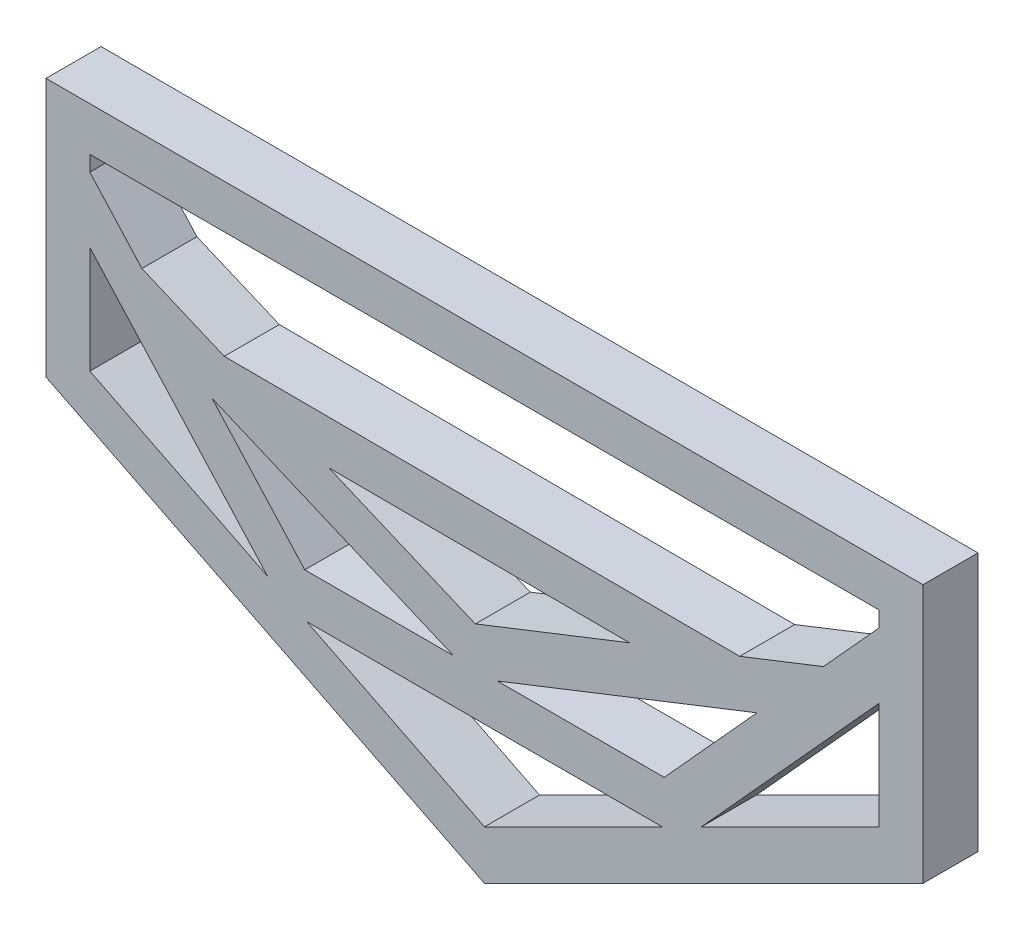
ISO-10303-21;
HEADER;
FILE_DESCRIPTION(('STEP AP214'),'2;1');
FILE_NAME('part.step','',(''),(''),'','','');
FILE_SCHEMA(('AUTOMOTIVE_DESIGN { 1 0 10303 214 1 1 1 1 }'));
ENDSEC;
DATA;
#1=APPLICATION_CONTEXT('core data for automotive mechanical design processes');
#2=APPLICATION_PROTOCOL_DEFINITION('international standard','automotive_design',2000,#1);
#3=PRODUCT_CONTEXT('',#1,'mechanical');
#4=PRODUCT('Part','Part','',(#3));
#5=PRODUCT_RELATED_PRODUCT_CATEGORY('part','',(#4));
#6=PRODUCT_DEFINITION_FORMATION('','',#4);
#7=PRODUCT_DEFINITION_CONTEXT('part definition',#1,'design');
#8=PRODUCT_DEFINITION('design','',#6,#7);
#9=PRODUCT_DEFINITION_SHAPE('','',#8);
#10=(LENGTH_UNIT() NAMED_UNIT(*) SI_UNIT(.MILLI.,.METRE.));
#11=(NAMED_UNIT(*) PLANE_ANGLE_UNIT() SI_UNIT($,.RADIAN.));
#12=(NAMED_UNIT(*) SI_UNIT($,.STERADIAN.) SOLID_ANGLE_UNIT());
#13=UNCERTAINTY_MEASURE_WITH_UNIT(LENGTH_MEASURE(1.E-05),#10,'distance_accuracy_value','');
#14=(GEOMETRIC_REPRESENTATION_CONTEXT(3) GLOBAL_UNCERTAINTY_ASSIGNED_CONTEXT((#13)) GLOBAL_UNIT_ASSIGNED_CONTEXT((#10,
#11,#12)) REPRESENTATION_CONTEXT('',''));
#15=CARTESIAN_POINT('',(0.,0.,0.));
#16=DIRECTION('',(0.,0.,1.));
#17=DIRECTION('',(1.,0.,0.));
#18=AXIS2_PLACEMENT_3D('',#15,#16,#17);
#19=CARTESIAN_POINT('',(0.,0.,19.));
#20=DIRECTION('',(0.,0.,-1.));
#21=DIRECTION('',(-1.,0.,0.));
#22=AXIS2_PLACEMENT_3D('',#19,#20,#21);
#23=PLANE('',#22);
#24=DIRECTION('',(0.671904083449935,-0.740638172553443,0.));
#25=VECTOR('',#24,1.);
#26=CARTESIAN_POINT('',(-57.6586050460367,53.1441461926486,19.));
#27=LINE('',#26,#25);
#28=CARTESIAN_POINT('',(-57.6586050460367,53.1441461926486,19.));
#29=VERTEX_POINT('',#28);
#30=CARTESIAN_POINT('',(-25.6346148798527,17.844182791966,19.));
#31=VERTEX_POINT('',#30);
#32=EDGE_CURVE('E269',#29,#31,#27,.T.);
#33=ORIENTED_EDGE('',*,*,#32,.F.);
#34=DIRECTION('',(-0.920875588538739,0.389856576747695,0.));
#35=VECTOR('',#34,1.);
#36=CARTESIAN_POINT('',(-57.6586050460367,53.1441461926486,19.));
#37=LINE('',#36,#35);
#38=CARTESIAN_POINT('',(25.7230191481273,17.844182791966,19.));
#39=VERTEX_POINT('',#38);
#40=EDGE_CURVE('E275',#39,#29,#37,.T.);
#41=ORIENTED_EDGE('',*,*,#40,.F.);
#42=DIRECTION('',(1.,0.,0.));
#43=VECTOR('',#42,1.);
#44=CARTESIAN_POINT('',(-25.6346148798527,17.844182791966,19.));
#45=LINE('',#44,#43);
#46=EDGE_CURVE('E271',#31,#39,#45,.T.);
#47=ORIENTED_EDGE('',*,*,#46,.F.);
#48=EDGE_LOOP('',(#33,#41,#47));
#49=FACE_BOUND('',#48,.T.);
#50=DIRECTION('',(0.,-1.,0.));
#51=VECTOR('',#50,1.);
#52=CARTESIAN_POINT('',(-99.8571427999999,77.1222571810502,19.));
#53=LINE('',#52,#51);
#54=CARTESIAN_POINT('',(-99.8571427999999,77.1222571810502,19.));
#55=VERTEX_POINT('',#54);
#56=CARTESIAN_POINT('',(-99.8571427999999,40.1588000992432,19.));
#57=VERTEX_POINT('',#56);
#58=EDGE_CURVE('E324',#55,#57,#53,.T.);
#59=ORIENTED_EDGE('',*,*,#58,.F.);
#60=DIRECTION('',(-0.671904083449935,0.740638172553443,0.));
#61=VECTOR('',#60,1.);
#62=CARTESIAN_POINT('',(-99.8571427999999,77.1222571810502,19.));
#63=LINE('',#62,#61);
#64=CARTESIAN_POINT('',(-38.4863770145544,9.47341720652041,19.));
#65=VERTEX_POINT('',#64);
#66=EDGE_CURVE('E330',#65,#55,#63,.T.);
#67=ORIENTED_EDGE('',*,*,#66,.F.);
#68=DIRECTION('',(0.894427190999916,-0.447213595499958,0.));
#69=VECTOR('',#68,1.);
#70=CARTESIAN_POINT('',(-99.8571427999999,40.1588000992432,19.));
#71=LINE('',#70,#69);
#72=EDGE_CURVE('E326',#57,#65,#71,.T.);
#73=ORIENTED_EDGE('',*,*,#72,.F.);
#74=EDGE_LOOP('',(#59,#67,#73));
#75=FACE_BOUND('',#74,.T.);
#76=DIRECTION('',(-1.,0.,0.));
#77=VECTOR('',#76,1.);
#78=CARTESIAN_POINT('',(-99.8571427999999,104.999999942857,19.));
#79=LINE('',#78,#77);
#80=CARTESIAN_POINT('',(172.7142868,104.999999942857,19.));
#81=VERTEX_POINT('',#80);
#82=CARTESIAN_POINT('',(-99.8571427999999,104.999999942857,19.));
#83=VERTEX_POINT('',#82);
#84=EDGE_CURVE('E372',#81,#83,#79,.T.);
#85=ORIENTED_EDGE('',*,*,#84,.F.);
#86=DIRECTION('',(0.,1.,0.));
#87=VECTOR('',#86,1.);
#88=CARTESIAN_POINT('',(172.7142868,104.999999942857,19.));
#89=LINE('',#88,#87);
#90=CARTESIAN_POINT('',(172.7142868,99.659487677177,19.));
#91=VERTEX_POINT('',#90);
#92=EDGE_CURVE('E388',#91,#81,#89,.T.);
#93=ORIENTED_EDGE('',*,*,#92,.F.);
#94=DIRECTION('',(0.671904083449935,0.740638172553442,0.));
#95=VECTOR('',#94,1.);
#96=CARTESIAN_POINT('',(153.484637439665,78.4626938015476,19.));
#97=LINE('',#96,#95);
#98=CARTESIAN_POINT('',(153.484637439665,78.4626938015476,19.));
#99=VERTEX_POINT('',#98);
#100=EDGE_CURVE('E385',#99,#91,#97,.T.);
#101=ORIENTED_EDGE('',*,*,#100,.F.);
#102=DIRECTION('',(0.930467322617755,0.366374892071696,0.));
#103=VECTOR('',#102,1.);
#104=CARTESIAN_POINT('',(124.551423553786,67.0701356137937,19.));
#105=LINE('',#104,#103);
#106=CARTESIAN_POINT('',(124.551423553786,67.0701356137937,19.));
#107=VERTEX_POINT('',#106);
#108=EDGE_CURVE('E383',#107,#99,#105,.T.);
#109=ORIENTED_EDGE('',*,*,#108,.F.);
#110=DIRECTION('',(0.999991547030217,-0.00411167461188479,0.));
#111=VECTOR('',#110,1.);
#112=CARTESIAN_POINT('',(-53.4395837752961,67.8019829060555,19.));
#113=LINE('',#112,#111);
#114=CARTESIAN_POINT('',(-53.4395837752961,67.8019829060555,19.));
#115=VERTEX_POINT('',#114);
#116=EDGE_CURVE('E381',#115,#107,#113,.T.);
#117=ORIENTED_EDGE('',*,*,#116,.F.);
#118=DIRECTION('',(0.920875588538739,-0.389856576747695,0.));
#119=VECTOR('',#118,1.);
#120=CARTESIAN_POINT('',(-81.8785636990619,79.8417453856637,19.));
#121=LINE('',#120,#119);
#122=CARTESIAN_POINT('',(-81.8785636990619,79.8417453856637,19.));
#123=VERTEX_POINT('',#122);
#124=EDGE_CURVE('E379',#123,#115,#121,.T.);
#125=ORIENTED_EDGE('',*,*,#124,.F.);
#126=DIRECTION('',(0.671904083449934,-0.740638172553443,0.));
#127=VECTOR('',#126,1.);
#128=CARTESIAN_POINT('',(-99.8571427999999,99.659487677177,19.));
#129=LINE('',#128,#127);
#130=CARTESIAN_POINT('',(-99.8571427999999,99.659487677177,19.));
#131=VERTEX_POINT('',#130);
#132=EDGE_CURVE('E377',#131,#123,#129,.T.);
#133=ORIENTED_EDGE('',*,*,#132,.F.);
#134=DIRECTION('',(0.,-1.,0.));
#135=VECTOR('',#134,1.);
#136=CARTESIAN_POINT('',(-99.8571427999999,104.999999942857,19.));
#137=LINE('',#136,#135);
#138=EDGE_CURVE('E374',#83,#131,#137,.T.);
#139=ORIENTED_EDGE('',*,*,#138,.F.);
#140=EDGE_LOOP('',(#85,#93,#101,#109,#117,#125,#133,#139));
#141=FACE_BOUND('',#140,.T.);
#142=DIRECTION('',(-1.,0.,0.));
#143=VECTOR('',#142,1.);
#144=CARTESIAN_POINT('',(-115.,120.142857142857,19.));
#145=LINE('',#144,#143);
#146=CARTESIAN_POINT('',(187.857144,120.142857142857,19.));
#147=VERTEX_POINT('',#146);
#148=CARTESIAN_POINT('',(-115.,120.142857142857,19.));
#149=VERTEX_POINT('',#148);
#150=EDGE_CURVE('E455',#147,#149,#145,.T.);
#151=ORIENTED_EDGE('',*,*,#150,.T.);
#152=DIRECTION('',(0.,-1.,0.));
#153=VECTOR('',#152,1.);
#154=CARTESIAN_POINT('',(-115.,120.142857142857,19.));
#155=LINE('',#154,#153);
#156=CARTESIAN_POINT('',(-115.,30.7999996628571,19.));
#157=VERTEX_POINT('',#156);
#158=EDGE_CURVE('E458',#149,#157,#155,.T.);
#159=ORIENTED_EDGE('',*,*,#158,.T.);
#160=DIRECTION('',(0.894427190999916,-0.447213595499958,0.));
#161=VECTOR('',#160,1.);
#162=CARTESIAN_POINT('',(-115.,30.7999996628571,19.));
#163=LINE('',#162,#161);
#164=CARTESIAN_POINT('',(36.4285720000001,-44.9142863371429,19.));
#165=VERTEX_POINT('',#164);
#166=EDGE_CURVE('E461',#157,#165,#163,.T.);
#167=ORIENTED_EDGE('',*,*,#166,.T.);
#168=DIRECTION('',(0.894427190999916,0.447213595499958,0.));
#169=VECTOR('',#168,1.);
#170=CARTESIAN_POINT('',(36.4285720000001,-44.9142863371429,19.));
#171=LINE('',#170,#169);
#172=CARTESIAN_POINT('',(187.857144,30.7999996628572,19.));
#173=VERTEX_POINT('',#172);
#174=EDGE_CURVE('E463',#165,#173,#171,.T.);
#175=ORIENTED_EDGE('',*,*,#174,.T.);
#176=DIRECTION('',(0.,1.,0.));
#177=VECTOR('',#176,1.);
#178=CARTESIAN_POINT('',(187.857144,120.142857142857,19.));
#179=LINE('',#178,#177);
#180=EDGE_CURVE('E465',#173,#147,#179,.T.);
#181=ORIENTED_EDGE('',*,*,#180,.T.);
#182=EDGE_LOOP('',(#151,#159,#167,#175,#181));
#183=FACE_BOUND('',#182,.T.);
#184=DIRECTION('',(0.,1.,0.));
#185=VECTOR('',#184,1.);
#186=CARTESIAN_POINT('',(172.7142868,77.1222571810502,19.));
#187=LINE('',#186,#185);
#188=CARTESIAN_POINT('',(172.7142868,40.1588000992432,19.));
#189=VERTEX_POINT('',#188);
#190=CARTESIAN_POINT('',(172.7142868,77.1222571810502,19.));
#191=VERTEX_POINT('',#190);
#192=EDGE_CURVE('E431',#189,#191,#187,.T.);
#193=ORIENTED_EDGE('',*,*,#192,.F.);
#194=DIRECTION('',(0.894427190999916,0.447213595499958,0.));
#195=VECTOR('',#194,1.);
#196=CARTESIAN_POINT('',(111.343521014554,9.47341720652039,19.));
#197=LINE('',#196,#195);
#198=CARTESIAN_POINT('',(111.343521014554,9.47341720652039,19.));
#199=VERTEX_POINT('',#198);
#200=EDGE_CURVE('E437',#199,#189,#197,.T.);
#201=ORIENTED_EDGE('',*,*,#200,.F.);
#202=DIRECTION('',(-0.671904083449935,-0.740638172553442,0.));
#203=VECTOR('',#202,1.);
#204=CARTESIAN_POINT('',(111.343521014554,9.47341720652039,19.));
#205=LINE('',#204,#203);
#206=EDGE_CURVE('E433',#191,#199,#205,.T.);
#207=ORIENTED_EDGE('',*,*,#206,.F.);
#208=EDGE_LOOP('',(#193,#201,#207));
#209=FACE_BOUND('',#208,.T.);
#210=DIRECTION('',(0.894427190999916,-0.447213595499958,0.));
#211=VECTOR('',#210,1.);
#212=CARTESIAN_POINT('',(-24.9421937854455,2.70132559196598,19.));
#213=LINE('',#212,#211);
#214=CARTESIAN_POINT('',(-24.9421937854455,2.70132559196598,19.));
#215=VERTEX_POINT('',#214);
#216=CARTESIAN_POINT('',(36.4285720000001,-27.9840573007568,19.));
#217=VERTEX_POINT('',#216);
#218=EDGE_CURVE('E348',#215,#217,#213,.T.);
#219=ORIENTED_EDGE('',*,*,#218,.F.);
#220=DIRECTION('',(-1.,0.,0.));
#221=VECTOR('',#220,1.);
#222=CARTESIAN_POINT('',(-24.9421937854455,2.70132559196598,19.));
#223=LINE('',#222,#221);
#224=CARTESIAN_POINT('',(97.7993377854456,2.70132559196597,19.));
#225=VERTEX_POINT('',#224);
#226=EDGE_CURVE('E354',#225,#215,#223,.T.);
#227=ORIENTED_EDGE('',*,*,#226,.F.);
#228=DIRECTION('',(0.894427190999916,0.447213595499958,0.));
#229=VECTOR('',#228,1.);
#230=CARTESIAN_POINT('',(36.4285720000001,-27.9840573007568,19.));
#231=LINE('',#230,#229);
#232=EDGE_CURVE('E350',#217,#225,#231,.T.);
#233=ORIENTED_EDGE('',*,*,#232,.F.);
#234=EDGE_LOOP('',(#219,#227,#233));
#235=FACE_BOUND('',#234,.T.);
#236=DIRECTION('',(0.930467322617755,0.366374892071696,0.));
#237=VECTOR('',#236,1.);
#238=CARTESIAN_POINT('',(33.2944477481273,31.1373695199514,19.));
#239=LINE('',#238,#237);
#240=CARTESIAN_POINT('',(33.2944477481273,31.1373695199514,19.));
#241=VERTEX_POINT('',#240);
#242=CARTESIAN_POINT('',(86.4908451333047,52.0836444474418,19.));
#243=VERTEX_POINT('',#242);
#244=EDGE_CURVE('E293',#241,#243,#239,.T.);
#245=ORIENTED_EDGE('',*,*,#244,.F.);
#246=DIRECTION('',(-2.54144745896E-13,1.,0.));
#247=VECTOR('',#246,1.);
#248=CARTESIAN_POINT('',(33.2944477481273,31.1373695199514,19.));
#249=LINE('',#248,#247);
#250=CARTESIAN_POINT('',(33.2944477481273,31.0827636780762,19.));
#251=VERTEX_POINT('',#250);
#252=EDGE_CURVE('E301',#251,#241,#249,.T.);
#253=ORIENTED_EDGE('',*,*,#252,.F.);
#254=DIRECTION('',(0.920875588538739,-0.389856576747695,0.));
#255=VECTOR('',#254,1.);
#256=CARTESIAN_POINT('',(-17.3197142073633,52.5104832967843,19.));
#257=LINE('',#256,#255);
#258=CARTESIAN_POINT('',(-17.3197142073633,52.5104832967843,19.));
#259=VERTEX_POINT('',#258);
#260=EDGE_CURVE('E298',#259,#251,#257,.T.);
#261=ORIENTED_EDGE('',*,*,#260,.F.);
#262=DIRECTION('',(-0.999991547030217,0.00411167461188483,0.));
#263=VECTOR('',#262,1.);
#264=CARTESIAN_POINT('',(-17.3197142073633,52.5104832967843,19.));
#265=LINE('',#264,#263);
#266=EDGE_CURVE('E295',#243,#259,#265,.T.);
#267=ORIENTED_EDGE('',*,*,#266,.F.);
#268=EDGE_LOOP('',(#245,#253,#261,#267));
#269=FACE_BOUND('',#268,.T.);
#270=DIRECTION('',(1.,0.,0.));
#271=VECTOR('',#270,1.);
#272=CARTESIAN_POINT('',(40.8658763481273,17.844182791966,19.));
#273=LINE('',#272,#271);
#274=CARTESIAN_POINT('',(40.8658763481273,17.844182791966,19.));
#275=VERTEX_POINT('',#274);
#276=CARTESIAN_POINT('',(98.4917588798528,17.844182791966,19.));
#277=VERTEX_POINT('',#276);
#278=EDGE_CURVE('E242',#275,#277,#273,.T.);
#279=ORIENTED_EDGE('',*,*,#278,.F.);
#280=DIRECTION('',(-0.930467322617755,-0.366374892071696,0.));
#281=VECTOR('',#280,1.);
#282=CARTESIAN_POINT('',(40.8658763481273,17.844182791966,19.));
#283=LINE('',#282,#281);
#284=CARTESIAN_POINT('',(130.515749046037,53.1441461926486,19.));
#285=VERTEX_POINT('',#284);
#286=EDGE_CURVE('E259',#285,#275,#283,.T.);
#287=ORIENTED_EDGE('',*,*,#286,.F.);
#288=DIRECTION('',(0.671904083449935,0.740638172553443,0.));
#289=VECTOR('',#288,1.);
#290=CARTESIAN_POINT('',(98.4917588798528,17.844182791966,19.));
#291=LINE('',#290,#289);
#292=EDGE_CURVE('E250',#277,#285,#291,.T.);
#293=ORIENTED_EDGE('',*,*,#292,.F.);
#294=EDGE_LOOP('',(#279,#287,#293));
#295=FACE_BOUND('',#294,.T.);
#296=ADVANCED_FACE('F33',(#49,#75,#141,#183,#209,#235,#269,#295),#23,.F.);
#297=CARTESIAN_POINT('',(0.,0.,0.));
#298=DIRECTION('',(0.,0.,-1.));
#299=DIRECTION('',(-1.,0.,0.));
#300=AXIS2_PLACEMENT_3D('',#297,#298,#299);
#301=PLANE('',#300);
#302=DIRECTION('',(-1.,0.,0.));
#303=VECTOR('',#302,1.);
#304=CARTESIAN_POINT('',(-115.,120.142857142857,0.));
#305=LINE('',#304,#303);
#306=CARTESIAN_POINT('',(187.857144,120.142857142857,0.));
#307=VERTEX_POINT('',#306);
#308=CARTESIAN_POINT('',(-115.,120.142857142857,0.));
#309=VERTEX_POINT('',#308);
#310=EDGE_CURVE('E454',#307,#309,#305,.T.);
#311=ORIENTED_EDGE('',*,*,#310,.F.);
#312=DIRECTION('',(0.,1.,0.));
#313=VECTOR('',#312,1.);
#314=CARTESIAN_POINT('',(187.857144,120.142857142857,0.));
#315=LINE('',#314,#313);
#316=CARTESIAN_POINT('',(187.857144,30.7999996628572,0.));
#317=VERTEX_POINT('',#316);
#318=EDGE_CURVE('E459',#317,#307,#315,.T.);
#319=ORIENTED_EDGE('',*,*,#318,.F.);
#320=DIRECTION('',(0.894427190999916,0.447213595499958,0.));
#321=VECTOR('',#320,1.);
#322=CARTESIAN_POINT('',(36.4285720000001,-44.9142863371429,0.));
#323=LINE('',#322,#321);
#324=CARTESIAN_POINT('',(36.4285720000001,-44.9142863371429,0.));
#325=VERTEX_POINT('',#324);
#326=EDGE_CURVE('E474',#325,#317,#323,.T.);
#327=ORIENTED_EDGE('',*,*,#326,.F.);
#328=DIRECTION('',(0.894427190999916,-0.447213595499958,0.));
#329=VECTOR('',#328,1.);
#330=CARTESIAN_POINT('',(-115.,30.7999996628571,0.));
#331=LINE('',#330,#329);
#332=CARTESIAN_POINT('',(-115.,30.7999996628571,0.));
#333=VERTEX_POINT('',#332);
#334=EDGE_CURVE('E472',#333,#325,#331,.T.);
#335=ORIENTED_EDGE('',*,*,#334,.F.);
#336=DIRECTION('',(0.,-1.,0.));
#337=VECTOR('',#336,1.);
#338=CARTESIAN_POINT('',(-115.,120.142857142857,0.));
#339=LINE('',#338,#337);
#340=EDGE_CURVE('E470',#309,#333,#339,.T.);
#341=ORIENTED_EDGE('',*,*,#340,.F.);
#342=EDGE_LOOP('',(#311,#319,#327,#335,#341));
#343=FACE_BOUND('',#342,.T.);
#344=DIRECTION('',(0.894427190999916,0.447213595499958,0.));
#345=VECTOR('',#344,1.);
#346=CARTESIAN_POINT('',(111.343521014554,9.47341720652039,0.));
#347=LINE('',#346,#345);
#348=CARTESIAN_POINT('',(111.343521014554,9.47341720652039,0.));
#349=VERTEX_POINT('',#348);
#350=CARTESIAN_POINT('',(172.7142868,40.1588000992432,0.));
#351=VERTEX_POINT('',#350);
#352=EDGE_CURVE('E434',#349,#351,#347,.T.);
#353=ORIENTED_EDGE('',*,*,#352,.T.);
#354=DIRECTION('',(0.,1.,0.));
#355=VECTOR('',#354,1.);
#356=CARTESIAN_POINT('',(172.7142868,77.1222571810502,0.));
#357=LINE('',#356,#355);
#358=CARTESIAN_POINT('',(172.7142868,77.1222571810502,0.));
#359=VERTEX_POINT('',#358);
#360=EDGE_CURVE('E430',#351,#359,#357,.T.);
#361=ORIENTED_EDGE('',*,*,#360,.T.);
#362=DIRECTION('',(-0.671904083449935,-0.740638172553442,0.));
#363=VECTOR('',#362,1.);
#364=CARTESIAN_POINT('',(111.343521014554,9.47341720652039,0.));
#365=LINE('',#364,#363);
#366=EDGE_CURVE('E442',#359,#349,#365,.T.);
#367=ORIENTED_EDGE('',*,*,#366,.T.);
#368=EDGE_LOOP('',(#353,#361,#367));
#369=FACE_BOUND('',#368,.T.);
#370=DIRECTION('',(0.,1.,0.));
#371=VECTOR('',#370,1.);
#372=CARTESIAN_POINT('',(172.7142868,104.999999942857,0.));
#373=LINE('',#372,#371);
#374=CARTESIAN_POINT('',(172.7142868,99.659487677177,0.));
#375=VERTEX_POINT('',#374);
#376=CARTESIAN_POINT('',(172.7142868,104.999999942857,0.));
#377=VERTEX_POINT('',#376);
#378=EDGE_CURVE('E375',#375,#377,#373,.T.);
#379=ORIENTED_EDGE('',*,*,#378,.T.);
#380=DIRECTION('',(-1.,0.,0.));
#381=VECTOR('',#380,1.);
#382=CARTESIAN_POINT('',(-99.8571427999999,104.999999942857,0.));
#383=LINE('',#382,#381);
#384=CARTESIAN_POINT('',(-99.8571427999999,104.999999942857,0.));
#385=VERTEX_POINT('',#384);
#386=EDGE_CURVE('E371',#377,#385,#383,.T.);
#387=ORIENTED_EDGE('',*,*,#386,.T.);
#388=DIRECTION('',(0.,-1.,0.));
#389=VECTOR('',#388,1.);
#390=CARTESIAN_POINT('',(-99.8571427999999,104.999999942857,0.));
#391=LINE('',#390,#389);
#392=CARTESIAN_POINT('',(-99.8571427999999,99.659487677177,0.));
#393=VERTEX_POINT('',#392);
#394=EDGE_CURVE('E393',#385,#393,#391,.T.);
#395=ORIENTED_EDGE('',*,*,#394,.T.);
#396=DIRECTION('',(0.671904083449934,-0.740638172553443,0.));
#397=VECTOR('',#396,1.);
#398=CARTESIAN_POINT('',(-99.8571427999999,99.659487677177,0.));
#399=LINE('',#398,#397);
#400=CARTESIAN_POINT('',(-81.8785636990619,79.8417453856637,0.));
#401=VERTEX_POINT('',#400);
#402=EDGE_CURVE('E396',#393,#401,#399,.T.);
#403=ORIENTED_EDGE('',*,*,#402,.T.);
#404=DIRECTION('',(0.920875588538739,-0.389856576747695,0.));
#405=VECTOR('',#404,1.);
#406=CARTESIAN_POINT('',(-81.8785636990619,79.8417453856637,0.));
#407=LINE('',#406,#405);
#408=CARTESIAN_POINT('',(-53.4395837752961,67.8019829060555,0.));
#409=VERTEX_POINT('',#408);
#410=EDGE_CURVE('E399',#401,#409,#407,.T.);
#411=ORIENTED_EDGE('',*,*,#410,.T.);
#412=DIRECTION('',(0.999991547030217,-0.00411167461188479,0.));
#413=VECTOR('',#412,1.);
#414=CARTESIAN_POINT('',(-53.4395837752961,67.8019829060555,0.));
#415=LINE('',#414,#413);
#416=CARTESIAN_POINT('',(124.551423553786,67.0701356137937,0.));
#417=VERTEX_POINT('',#416);
#418=EDGE_CURVE('E402',#409,#417,#415,.T.);
#419=ORIENTED_EDGE('',*,*,#418,.T.);
#420=DIRECTION('',(0.930467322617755,0.366374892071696,0.));
#421=VECTOR('',#420,1.);
#422=CARTESIAN_POINT('',(124.551423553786,67.0701356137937,0.));
#423=LINE('',#422,#421);
#424=CARTESIAN_POINT('',(153.484637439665,78.4626938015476,0.));
#425=VERTEX_POINT('',#424);
#426=EDGE_CURVE('E405',#417,#425,#423,.T.);
#427=ORIENTED_EDGE('',*,*,#426,.T.);
#428=DIRECTION('',(0.671904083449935,0.740638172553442,0.));
#429=VECTOR('',#428,1.);
#430=CARTESIAN_POINT('',(153.484637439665,78.4626938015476,0.));
#431=LINE('',#430,#429);
#432=EDGE_CURVE('E408',#425,#375,#431,.T.);
#433=ORIENTED_EDGE('',*,*,#432,.T.);
#434=EDGE_LOOP('',(#379,#387,#395,#403,#411,#419,#427,#433));
#435=FACE_BOUND('',#434,.T.);
#436=DIRECTION('',(-1.,0.,0.));
#437=VECTOR('',#436,1.);
#438=CARTESIAN_POINT('',(-24.9421937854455,2.70132559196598,0.));
#439=LINE('',#438,#437);
#440=CARTESIAN_POINT('',(97.7993377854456,2.70132559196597,0.));
#441=VERTEX_POINT('',#440);
#442=CARTESIAN_POINT('',(-24.9421937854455,2.70132559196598,0.));
#443=VERTEX_POINT('',#442);
#444=EDGE_CURVE('E351',#441,#443,#439,.T.);
#445=ORIENTED_EDGE('',*,*,#444,.T.);
#446=DIRECTION('',(0.894427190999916,-0.447213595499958,0.));
#447=VECTOR('',#446,1.);
#448=CARTESIAN_POINT('',(-24.9421937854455,2.70132559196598,0.));
#449=LINE('',#448,#447);
#450=CARTESIAN_POINT('',(36.4285720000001,-27.9840573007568,0.));
#451=VERTEX_POINT('',#450);
#452=EDGE_CURVE('E347',#443,#451,#449,.T.);
#453=ORIENTED_EDGE('',*,*,#452,.T.);
#454=DIRECTION('',(0.894427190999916,0.447213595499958,0.));
#455=VECTOR('',#454,1.);
#456=CARTESIAN_POINT('',(36.4285720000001,-27.9840573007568,0.));
#457=LINE('',#456,#455);
#458=EDGE_CURVE('E359',#451,#441,#457,.T.);
#459=ORIENTED_EDGE('',*,*,#458,.T.);
#460=EDGE_LOOP('',(#445,#453,#459));
#461=FACE_BOUND('',#460,.T.);
#462=DIRECTION('',(-0.671904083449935,0.740638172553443,0.));
#463=VECTOR('',#462,1.);
#464=CARTESIAN_POINT('',(-99.8571427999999,77.1222571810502,0.));
#465=LINE('',#464,#463);
#466=CARTESIAN_POINT('',(-38.4863770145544,9.47341720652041,0.));
#467=VERTEX_POINT('',#466);
#468=CARTESIAN_POINT('',(-99.8571427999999,77.1222571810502,0.));
#469=VERTEX_POINT('',#468);
#470=EDGE_CURVE('E327',#467,#469,#465,.T.);
#471=ORIENTED_EDGE('',*,*,#470,.T.);
#472=DIRECTION('',(0.,-1.,0.));
#473=VECTOR('',#472,1.);
#474=CARTESIAN_POINT('',(-99.8571427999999,77.1222571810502,0.));
#475=LINE('',#474,#473);
#476=CARTESIAN_POINT('',(-99.8571427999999,40.1588000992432,0.));
#477=VERTEX_POINT('',#476);
#478=EDGE_CURVE('E323',#469,#477,#475,.T.);
#479=ORIENTED_EDGE('',*,*,#478,.T.);
#480=DIRECTION('',(0.894427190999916,-0.447213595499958,0.));
#481=VECTOR('',#480,1.);
#482=CARTESIAN_POINT('',(-99.8571427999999,40.1588000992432,0.));
#483=LINE('',#482,#481);
#484=EDGE_CURVE('E335',#477,#467,#483,.T.);
#485=ORIENTED_EDGE('',*,*,#484,.T.);
#486=EDGE_LOOP('',(#471,#479,#485));
#487=FACE_BOUND('',#486,.T.);
#488=DIRECTION('',(-2.54144745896E-13,1.,0.));
#489=VECTOR('',#488,1.);
#490=CARTESIAN_POINT('',(33.2944477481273,31.1373695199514,0.));
#491=LINE('',#490,#489);
#492=CARTESIAN_POINT('',(33.2944477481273,31.0827636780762,0.));
#493=VERTEX_POINT('',#492);
#494=CARTESIAN_POINT('',(33.2944477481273,31.1373695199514,0.));
#495=VERTEX_POINT('',#494);
#496=EDGE_CURVE('E296',#493,#495,#491,.T.);
#497=ORIENTED_EDGE('',*,*,#496,.T.);
#498=DIRECTION('',(0.930467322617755,0.366374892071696,0.));
#499=VECTOR('',#498,1.);
#500=CARTESIAN_POINT('',(33.2944477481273,31.1373695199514,0.));
#501=LINE('',#500,#499);
#502=CARTESIAN_POINT('',(86.4908451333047,52.0836444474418,0.));
#503=VERTEX_POINT('',#502);
#504=EDGE_CURVE('E292',#495,#503,#501,.T.);
#505=ORIENTED_EDGE('',*,*,#504,.T.);
#506=DIRECTION('',(-0.999991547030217,0.00411167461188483,0.));
#507=VECTOR('',#506,1.);
#508=CARTESIAN_POINT('',(-17.3197142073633,52.5104832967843,0.));
#509=LINE('',#508,#507);
#510=CARTESIAN_POINT('',(-17.3197142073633,52.5104832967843,0.));
#511=VERTEX_POINT('',#510);
#512=EDGE_CURVE('E306',#503,#511,#509,.T.);
#513=ORIENTED_EDGE('',*,*,#512,.T.);
#514=DIRECTION('',(0.920875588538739,-0.389856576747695,0.));
#515=VECTOR('',#514,1.);
#516=CARTESIAN_POINT('',(-17.3197142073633,52.5104832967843,0.));
#517=LINE('',#516,#515);
#518=EDGE_CURVE('E309',#511,#493,#517,.T.);
#519=ORIENTED_EDGE('',*,*,#518,.T.);
#520=EDGE_LOOP('',(#497,#505,#513,#519));
#521=FACE_BOUND('',#520,.T.);
#522=DIRECTION('',(-0.920875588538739,0.389856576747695,0.));
#523=VECTOR('',#522,1.);
#524=CARTESIAN_POINT('',(-57.6586050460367,53.1441461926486,0.));
#525=LINE('',#524,#523);
#526=CARTESIAN_POINT('',(25.7230191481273,17.844182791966,0.));
#527=VERTEX_POINT('',#526);
#528=CARTESIAN_POINT('',(-57.6586050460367,53.1441461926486,0.));
#529=VERTEX_POINT('',#528);
#530=EDGE_CURVE('E272',#527,#529,#525,.T.);
#531=ORIENTED_EDGE('',*,*,#530,.T.);
#532=DIRECTION('',(0.671904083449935,-0.740638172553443,0.));
#533=VECTOR('',#532,1.);
#534=CARTESIAN_POINT('',(-57.6586050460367,53.1441461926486,0.));
#535=LINE('',#534,#533);
#536=CARTESIAN_POINT('',(-25.6346148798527,17.844182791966,0.));
#537=VERTEX_POINT('',#536);
#538=EDGE_CURVE('E257',#529,#537,#535,.T.);
#539=ORIENTED_EDGE('',*,*,#538,.T.);
#540=DIRECTION('',(1.,0.,0.));
#541=VECTOR('',#540,1.);
#542=CARTESIAN_POINT('',(-25.6346148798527,17.844182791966,0.));
#543=LINE('',#542,#541);
#544=EDGE_CURVE('E280',#537,#527,#543,.T.);
#545=ORIENTED_EDGE('',*,*,#544,.T.);
#546=EDGE_LOOP('',(#531,#539,#545));
#547=FACE_BOUND('',#546,.T.);
#548=DIRECTION('',(-0.930467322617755,-0.366374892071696,0.));
#549=VECTOR('',#548,1.);
#550=CARTESIAN_POINT('',(40.8658763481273,17.844182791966,0.));
#551=LINE('',#550,#549);
#552=CARTESIAN_POINT('',(130.515749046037,53.1441461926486,0.));
#553=VERTEX_POINT('',#552);
#554=CARTESIAN_POINT('',(40.8658763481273,17.844182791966,0.));
#555=VERTEX_POINT('',#554);
#556=EDGE_CURVE('E251',#553,#555,#551,.T.);
#557=ORIENTED_EDGE('',*,*,#556,.T.);
#558=DIRECTION('',(1.,0.,0.));
#559=VECTOR('',#558,1.);
#560=CARTESIAN_POINT('',(40.8658763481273,17.844182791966,0.));
#561=LINE('',#560,#559);
#562=CARTESIAN_POINT('',(98.4917588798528,17.844182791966,0.));
#563=VERTEX_POINT('',#562);
#564=EDGE_CURVE('E56',#555,#563,#561,.T.);
#565=ORIENTED_EDGE('',*,*,#564,.T.);
#566=DIRECTION('',(0.671904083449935,0.740638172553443,0.));
#567=VECTOR('',#566,1.);
#568=CARTESIAN_POINT('',(98.4917588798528,17.844182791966,0.));
#569=LINE('',#568,#567);
#570=EDGE_CURVE('E256',#563,#553,#569,.T.);
#571=ORIENTED_EDGE('',*,*,#570,.T.);
#572=EDGE_LOOP('',(#557,#565,#571));
#573=FACE_BOUND('',#572,.T.);
#574=ADVANCED_FACE('F495',(#343,#369,#435,#461,#487,#521,#547,#573),#301,.T.);
#575=CARTESIAN_POINT('',(-115.,120.142857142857,19.));
#576=DIRECTION('',(0.,-1.,0.));
#577=DIRECTION('',(0.,0.,-1.));
#578=AXIS2_PLACEMENT_3D('',#575,#576,#577);
#579=PLANE('',#578);
#580=ORIENTED_EDGE('',*,*,#310,.T.);
#581=DIRECTION('',(0.,0.,-1.));
#582=VECTOR('',#581,1.);
#583=CARTESIAN_POINT('',(-115.,120.142857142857,19.));
#584=LINE('',#583,#582);
#585=EDGE_CURVE('E11',#149,#309,#584,.T.);
#586=ORIENTED_EDGE('',*,*,#585,.F.);
#587=ORIENTED_EDGE('',*,*,#150,.F.);
#588=DIRECTION('',(0.,0.,-1.));
#589=VECTOR('',#588,1.);
#590=CARTESIAN_POINT('',(187.857144,120.142857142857,19.));
#591=LINE('',#590,#589);
#592=EDGE_CURVE('E467',#147,#307,#591,.T.);
#593=ORIENTED_EDGE('',*,*,#592,.T.);
#594=EDGE_LOOP('',(#580,#586,#587,#593));
#595=FACE_BOUND('',#594,.T.);
#596=ADVANCED_FACE('F35',(#595),#579,.F.);
#597=CARTESIAN_POINT('',(-115.,120.142857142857,19.));
#598=DIRECTION('',(1.,0.,0.));
#599=DIRECTION('',(0.,1.,0.));
#600=AXIS2_PLACEMENT_3D('',#597,#598,#599);
#601=PLANE('',#600);
#602=ORIENTED_EDGE('',*,*,#340,.T.);
#603=DIRECTION('',(0.,0.,-1.));
#604=VECTOR('',#603,1.);
#605=CARTESIAN_POINT('',(-115.,30.7999996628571,19.));
#606=LINE('',#605,#604);
#607=EDGE_CURVE('E41',#157,#333,#606,.T.);
#608=ORIENTED_EDGE('',*,*,#607,.F.);
#609=ORIENTED_EDGE('',*,*,#158,.F.);
#610=ORIENTED_EDGE('',*,*,#585,.T.);
#611=EDGE_LOOP('',(#602,#608,#609,#610));
#612=FACE_BOUND('',#611,.T.);
#613=ADVANCED_FACE('F510',(#612),#601,.F.);
#614=CARTESIAN_POINT('',(-115.,30.7999996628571,19.));
#615=DIRECTION('',(0.447213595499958,0.894427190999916,0.));
#616=DIRECTION('',(-0.894427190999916,0.447213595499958,0.));
#617=AXIS2_PLACEMENT_3D('',#614,#615,#616);
#618=PLANE('',#617);
#619=ORIENTED_EDGE('',*,*,#334,.T.);
#620=DIRECTION('',(0.,0.,-1.));
#621=VECTOR('',#620,1.);
#622=CARTESIAN_POINT('',(36.4285720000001,-44.9142863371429,19.));
#623=LINE('',#622,#621);
#624=EDGE_CURVE('E482',#165,#325,#623,.T.);
#625=ORIENTED_EDGE('',*,*,#624,.F.);
#626=ORIENTED_EDGE('',*,*,#166,.F.);
#627=ORIENTED_EDGE('',*,*,#607,.T.);
#628=EDGE_LOOP('',(#619,#625,#626,#627));
#629=FACE_BOUND('',#628,.T.);
#630=ADVANCED_FACE('F489',(#629),#618,.F.);
#631=CARTESIAN_POINT('',(36.4285720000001,-44.9142863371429,19.));
#632=DIRECTION('',(-0.447213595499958,0.894427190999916,0.));
#633=DIRECTION('',(-0.894427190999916,-0.447213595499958,0.));
#634=AXIS2_PLACEMENT_3D('',#631,#632,#633);
#635=PLANE('',#634);
#636=ORIENTED_EDGE('',*,*,#326,.T.);
#637=DIRECTION('',(0.,0.,-1.));
#638=VECTOR('',#637,1.);
#639=CARTESIAN_POINT('',(187.857144,30.7999996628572,19.));
#640=LINE('',#639,#638);
#641=EDGE_CURVE('E479',#173,#317,#640,.T.);
#642=ORIENTED_EDGE('',*,*,#641,.F.);
#643=ORIENTED_EDGE('',*,*,#174,.F.);
#644=ORIENTED_EDGE('',*,*,#624,.T.);
#645=EDGE_LOOP('',(#636,#642,#643,#644));
#646=FACE_BOUND('',#645,.T.);
#647=ADVANCED_FACE('F500',(#646),#635,.F.);
#648=CARTESIAN_POINT('',(187.857144,120.142857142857,19.));
#649=DIRECTION('',(-1.,0.,0.));
#650=DIRECTION('',(0.,-1.,0.));
#651=AXIS2_PLACEMENT_3D('',#648,#649,#650);
#652=PLANE('',#651);
#653=ORIENTED_EDGE('',*,*,#318,.T.);
#654=ORIENTED_EDGE('',*,*,#592,.F.);
#655=ORIENTED_EDGE('',*,*,#180,.F.);
#656=ORIENTED_EDGE('',*,*,#641,.T.);
#657=EDGE_LOOP('',(#653,#654,#655,#656));
#658=FACE_BOUND('',#657,.T.);
#659=ADVANCED_FACE('F504',(#658),#652,.F.);
#660=CARTESIAN_POINT('',(172.7142868,77.1222571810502,19.));
#661=DIRECTION('',(-1.,0.,0.));
#662=DIRECTION('',(0.,-1.,0.));
#663=AXIS2_PLACEMENT_3D('',#660,#661,#662);
#664=PLANE('',#663);
#665=ORIENTED_EDGE('',*,*,#360,.F.);
#666=DIRECTION('',(0.,0.,-1.));
#667=VECTOR('',#666,1.);
#668=CARTESIAN_POINT('',(172.7142868,40.1588000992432,19.));
#669=LINE('',#668,#667);
#670=EDGE_CURVE('E439',#189,#351,#669,.T.);
#671=ORIENTED_EDGE('',*,*,#670,.F.);
#672=ORIENTED_EDGE('',*,*,#192,.T.);
#673=DIRECTION('',(0.,0.,-1.));
#674=VECTOR('',#673,1.);
#675=CARTESIAN_POINT('',(172.7142868,77.1222571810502,19.));
#676=LINE('',#675,#674);
#677=EDGE_CURVE('E451',#191,#359,#676,.T.);
#678=ORIENTED_EDGE('',*,*,#677,.T.);
#679=EDGE_LOOP('',(#665,#671,#672,#678));
#680=FACE_BOUND('',#679,.T.);
#681=ADVANCED_FACE('F526',(#680),#664,.T.);
#682=CARTESIAN_POINT('',(111.343521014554,9.47341720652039,19.));
#683=DIRECTION('',(0.740638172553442,-0.671904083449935,0.));
#684=DIRECTION('',(0.671904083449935,0.740638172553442,0.));
#685=AXIS2_PLACEMENT_3D('',#682,#683,#684);
#686=PLANE('',#685);
#687=ORIENTED_EDGE('',*,*,#366,.F.);
#688=ORIENTED_EDGE('',*,*,#677,.F.);
#689=ORIENTED_EDGE('',*,*,#206,.T.);
#690=DIRECTION('',(0.,0.,-1.));
#691=VECTOR('',#690,1.);
#692=CARTESIAN_POINT('',(111.343521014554,9.47341720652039,19.));
#693=LINE('',#692,#691);
#694=EDGE_CURVE('E449',#199,#349,#693,.T.);
#695=ORIENTED_EDGE('',*,*,#694,.T.);
#696=EDGE_LOOP('',(#687,#688,#689,#695));
#697=FACE_BOUND('',#696,.T.);
#698=ADVANCED_FACE('F552',(#697),#686,.T.);
#699=CARTESIAN_POINT('',(111.343521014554,9.47341720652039,19.));
#700=DIRECTION('',(-0.447213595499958,0.894427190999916,0.));
#701=DIRECTION('',(-0.894427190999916,-0.447213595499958,0.));
#702=AXIS2_PLACEMENT_3D('',#699,#700,#701);
#703=PLANE('',#702);
#704=ORIENTED_EDGE('',*,*,#352,.F.);
#705=ORIENTED_EDGE('',*,*,#694,.F.);
#706=ORIENTED_EDGE('',*,*,#200,.T.);
#707=ORIENTED_EDGE('',*,*,#670,.T.);
#708=EDGE_LOOP('',(#704,#705,#706,#707));
#709=FACE_BOUND('',#708,.T.);
#710=ADVANCED_FACE('F559',(#709),#703,.T.);
#711=CARTESIAN_POINT('',(-99.8571427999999,104.999999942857,19.));
#712=DIRECTION('',(0.,-1.,0.));
#713=DIRECTION('',(0.,0.,-1.));
#714=AXIS2_PLACEMENT_3D('',#711,#712,#713);
#715=PLANE('',#714);
#716=ORIENTED_EDGE('',*,*,#386,.F.);
#717=DIRECTION('',(0.,0.,-1.));
#718=VECTOR('',#717,1.);
#719=CARTESIAN_POINT('',(172.7142868,104.999999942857,19.));
#720=LINE('',#719,#718);
#721=EDGE_CURVE('E390',#81,#377,#720,.T.);
#722=ORIENTED_EDGE('',*,*,#721,.F.);
#723=ORIENTED_EDGE('',*,*,#84,.T.);
#724=DIRECTION('',(0.,0.,-1.));
#725=VECTOR('',#724,1.);
#726=CARTESIAN_POINT('',(-99.8571427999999,104.999999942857,19.));
#727=LINE('',#726,#725);
#728=EDGE_CURVE('E427',#83,#385,#727,.T.);
#729=ORIENTED_EDGE('',*,*,#728,.T.);
#730=EDGE_LOOP('',(#716,#722,#723,#729));
#731=FACE_BOUND('',#730,.T.);
#732=ADVANCED_FACE('F566',(#731),#715,.T.);
#733=CARTESIAN_POINT('',(-99.8571427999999,104.999999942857,19.));
#734=DIRECTION('',(1.,0.,0.));
#735=DIRECTION('',(0.,0.,-1.));
#736=AXIS2_PLACEMENT_3D('',#733,#734,#735);
#737=PLANE('',#736);
#738=ORIENTED_EDGE('',*,*,#394,.F.);
#739=ORIENTED_EDGE('',*,*,#728,.F.);
#740=ORIENTED_EDGE('',*,*,#138,.T.);
#741=DIRECTION('',(0.,0.,-1.));
#742=VECTOR('',#741,1.);
#743=CARTESIAN_POINT('',(-99.8571427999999,99.659487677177,19.));
#744=LINE('',#743,#742);
#745=EDGE_CURVE('E425',#131,#393,#744,.T.);
#746=ORIENTED_EDGE('',*,*,#745,.T.);
#747=EDGE_LOOP('',(#738,#739,#740,#746));
#748=FACE_BOUND('',#747,.T.);
#749=ADVANCED_FACE('F574',(#748),#737,.T.);
#750=CARTESIAN_POINT('',(-99.8571427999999,99.659487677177,19.));
#751=DIRECTION('',(0.740638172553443,0.671904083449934,0.));
#752=DIRECTION('',(-0.671904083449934,0.740638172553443,0.));
#753=AXIS2_PLACEMENT_3D('',#750,#751,#752);
#754=PLANE('',#753);
#755=ORIENTED_EDGE('',*,*,#402,.F.);
#756=ORIENTED_EDGE('',*,*,#745,.F.);
#757=ORIENTED_EDGE('',*,*,#132,.T.);
#758=DIRECTION('',(0.,0.,-1.));
#759=VECTOR('',#758,1.);
#760=CARTESIAN_POINT('',(-81.8785636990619,79.8417453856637,19.));
#761=LINE('',#760,#759);
#762=EDGE_CURVE('E423',#123,#401,#761,.T.);
#763=ORIENTED_EDGE('',*,*,#762,.T.);
#764=EDGE_LOOP('',(#755,#756,#757,#763));
#765=FACE_BOUND('',#764,.T.);
#766=ADVANCED_FACE('F582',(#765),#754,.T.);
#767=CARTESIAN_POINT('',(-81.8785636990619,79.8417453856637,19.));
#768=DIRECTION('',(0.389856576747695,0.920875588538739,0.));
#769=DIRECTION('',(-0.920875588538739,0.389856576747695,0.));
#770=AXIS2_PLACEMENT_3D('',#767,#768,#769);
#771=PLANE('',#770);
#772=ORIENTED_EDGE('',*,*,#410,.F.);
#773=ORIENTED_EDGE('',*,*,#762,.F.);
#774=ORIENTED_EDGE('',*,*,#124,.T.);
#775=DIRECTION('',(0.,0.,-1.));
#776=VECTOR('',#775,1.);
#777=CARTESIAN_POINT('',(-53.4395837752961,67.8019829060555,19.));
#778=LINE('',#777,#776);
#779=EDGE_CURVE('E421',#115,#409,#778,.T.);
#780=ORIENTED_EDGE('',*,*,#779,.T.);
#781=EDGE_LOOP('',(#772,#773,#774,#780));
#782=FACE_BOUND('',#781,.T.);
#783=ADVANCED_FACE('F590',(#782),#771,.T.);
#784=CARTESIAN_POINT('',(-53.4395837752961,67.8019829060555,19.));
#785=DIRECTION('',(0.00411167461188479,0.999991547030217,0.));
#786=DIRECTION('',(-0.999991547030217,0.00411167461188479,0.));
#787=AXIS2_PLACEMENT_3D('',#784,#785,#786);
#788=PLANE('',#787);
#789=ORIENTED_EDGE('',*,*,#418,.F.);
#790=ORIENTED_EDGE('',*,*,#779,.F.);
#791=ORIENTED_EDGE('',*,*,#116,.T.);
#792=DIRECTION('',(0.,0.,-1.));
#793=VECTOR('',#792,1.);
#794=CARTESIAN_POINT('',(124.551423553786,67.0701356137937,19.));
#795=LINE('',#794,#793);
#796=EDGE_CURVE('E419',#107,#417,#795,.T.);
#797=ORIENTED_EDGE('',*,*,#796,.T.);
#798=EDGE_LOOP('',(#789,#790,#791,#797));
#799=FACE_BOUND('',#798,.T.);
#800=ADVANCED_FACE('F598',(#799),#788,.T.);
#801=CARTESIAN_POINT('',(124.551423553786,67.0701356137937,19.));
#802=DIRECTION('',(-0.366374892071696,0.930467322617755,0.));
#803=DIRECTION('',(-0.930467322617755,-0.366374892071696,0.));
#804=AXIS2_PLACEMENT_3D('',#801,#802,#803);
#805=PLANE('',#804);
#806=ORIENTED_EDGE('',*,*,#426,.F.);
#807=ORIENTED_EDGE('',*,*,#796,.F.);
#808=ORIENTED_EDGE('',*,*,#108,.T.);
#809=DIRECTION('',(0.,0.,-1.));
#810=VECTOR('',#809,1.);
#811=CARTESIAN_POINT('',(153.484637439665,78.4626938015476,19.));
#812=LINE('',#811,#810);
#813=EDGE_CURVE('E417',#99,#425,#812,.T.);
#814=ORIENTED_EDGE('',*,*,#813,.T.);
#815=EDGE_LOOP('',(#806,#807,#808,#814));
#816=FACE_BOUND('',#815,.T.);
#817=ADVANCED_FACE('F606',(#816),#805,.T.);
#818=CARTESIAN_POINT('',(153.484637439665,78.4626938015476,19.));
#819=DIRECTION('',(-0.740638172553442,0.671904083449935,0.));
#820=DIRECTION('',(-0.671904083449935,-0.740638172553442,0.));
#821=AXIS2_PLACEMENT_3D('',#818,#819,#820);
#822=PLANE('',#821);
#823=ORIENTED_EDGE('',*,*,#432,.F.);
#824=ORIENTED_EDGE('',*,*,#813,.F.);
#825=ORIENTED_EDGE('',*,*,#100,.T.);
#826=DIRECTION('',(0.,0.,-1.));
#827=VECTOR('',#826,1.);
#828=CARTESIAN_POINT('',(172.7142868,99.659487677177,19.));
#829=LINE('',#828,#827);
#830=EDGE_CURVE('E415',#91,#375,#829,.T.);
#831=ORIENTED_EDGE('',*,*,#830,.T.);
#832=EDGE_LOOP('',(#823,#824,#825,#831));
#833=FACE_BOUND('',#832,.T.);
#834=ADVANCED_FACE('F614',(#833),#822,.T.);
#835=CARTESIAN_POINT('',(172.7142868,104.999999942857,19.));
#836=DIRECTION('',(-1.,0.,0.));
#837=DIRECTION('',(0.,-1.,0.));
#838=AXIS2_PLACEMENT_3D('',#835,#836,#837);
#839=PLANE('',#838);
#840=ORIENTED_EDGE('',*,*,#378,.F.);
#841=ORIENTED_EDGE('',*,*,#830,.F.);
#842=ORIENTED_EDGE('',*,*,#92,.T.);
#843=ORIENTED_EDGE('',*,*,#721,.T.);
#844=EDGE_LOOP('',(#840,#841,#842,#843));
#845=FACE_BOUND('',#844,.T.);
#846=ADVANCED_FACE('F622',(#845),#839,.T.);
#847=CARTESIAN_POINT('',(-24.9421937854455,2.70132559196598,19.));
#848=DIRECTION('',(0.447213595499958,0.894427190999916,0.));
#849=DIRECTION('',(-0.894427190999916,0.447213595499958,0.));
#850=AXIS2_PLACEMENT_3D('',#847,#848,#849);
#851=PLANE('',#850);
#852=ORIENTED_EDGE('',*,*,#452,.F.);
#853=DIRECTION('',(0.,0.,-1.));
#854=VECTOR('',#853,1.);
#855=CARTESIAN_POINT('',(-24.9421937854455,2.70132559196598,19.));
#856=LINE('',#855,#854);
#857=EDGE_CURVE('E356',#215,#443,#856,.T.);
#858=ORIENTED_EDGE('',*,*,#857,.F.);
#859=ORIENTED_EDGE('',*,*,#218,.T.);
#860=DIRECTION('',(0.,0.,-1.));
#861=VECTOR('',#860,1.);
#862=CARTESIAN_POINT('',(36.4285720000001,-27.9840573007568,19.));
#863=LINE('',#862,#861);
#864=EDGE_CURVE('E368',#217,#451,#863,.T.);
#865=ORIENTED_EDGE('',*,*,#864,.T.);
#866=EDGE_LOOP('',(#852,#858,#859,#865));
#867=FACE_BOUND('',#866,.T.);
#868=ADVANCED_FACE('F630',(#867),#851,.T.);
#869=CARTESIAN_POINT('',(36.4285720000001,-27.9840573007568,19.));
#870=DIRECTION('',(-0.447213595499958,0.894427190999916,0.));
#871=DIRECTION('',(-0.894427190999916,-0.447213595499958,0.));
#872=AXIS2_PLACEMENT_3D('',#869,#870,#871);
#873=PLANE('',#872);
#874=ORIENTED_EDGE('',*,*,#458,.F.);
#875=ORIENTED_EDGE('',*,*,#864,.F.);
#876=ORIENTED_EDGE('',*,*,#232,.T.);
#877=DIRECTION('',(0.,0.,-1.));
#878=VECTOR('',#877,1.);
#879=CARTESIAN_POINT('',(97.7993377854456,2.70132559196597,19.));
#880=LINE('',#879,#878);
#881=EDGE_CURVE('E366',#225,#441,#880,.T.);
#882=ORIENTED_EDGE('',*,*,#881,.T.);
#883=EDGE_LOOP('',(#874,#875,#876,#882));
#884=FACE_BOUND('',#883,.T.);
#885=ADVANCED_FACE('F638',(#884),#873,.T.);
#886=CARTESIAN_POINT('',(-24.9421937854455,2.70132559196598,19.));
#887=DIRECTION('',(0.,-1.,0.));
#888=DIRECTION('',(1.,0.,0.));
#889=AXIS2_PLACEMENT_3D('',#886,#887,#888);
#890=PLANE('',#889);
#891=ORIENTED_EDGE('',*,*,#444,.F.);
#892=ORIENTED_EDGE('',*,*,#881,.F.);
#893=ORIENTED_EDGE('',*,*,#226,.T.);
#894=ORIENTED_EDGE('',*,*,#857,.T.);
#895=EDGE_LOOP('',(#891,#892,#893,#894));
#896=FACE_BOUND('',#895,.T.);
#897=ADVANCED_FACE('F646',(#896),#890,.T.);
#898=CARTESIAN_POINT('',(-99.8571427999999,77.1222571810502,19.));
#899=DIRECTION('',(1.,0.,0.));
#900=DIRECTION('',(0.,0.,-1.));
#901=AXIS2_PLACEMENT_3D('',#898,#899,#900);
#902=PLANE('',#901);
#903=ORIENTED_EDGE('',*,*,#478,.F.);
#904=DIRECTION('',(0.,0.,-1.));
#905=VECTOR('',#904,1.);
#906=CARTESIAN_POINT('',(-99.8571427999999,77.1222571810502,19.));
#907=LINE('',#906,#905);
#908=EDGE_CURVE('E332',#55,#469,#907,.T.);
#909=ORIENTED_EDGE('',*,*,#908,.F.);
#910=ORIENTED_EDGE('',*,*,#58,.T.);
#911=DIRECTION('',(0.,0.,-1.));
#912=VECTOR('',#911,1.);
#913=CARTESIAN_POINT('',(-99.8571427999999,40.1588000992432,19.));
#914=LINE('',#913,#912);
#915=EDGE_CURVE('E344',#57,#477,#914,.T.);
#916=ORIENTED_EDGE('',*,*,#915,.T.);
#917=EDGE_LOOP('',(#903,#909,#910,#916));
#918=FACE_BOUND('',#917,.T.);
#919=ADVANCED_FACE('F654',(#918),#902,.T.);
#920=CARTESIAN_POINT('',(-99.8571427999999,40.1588000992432,19.));
#921=DIRECTION('',(0.447213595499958,0.894427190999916,0.));
#922=DIRECTION('',(-0.894427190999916,0.447213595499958,0.));
#923=AXIS2_PLACEMENT_3D('',#920,#921,#922);
#924=PLANE('',#923);
#925=ORIENTED_EDGE('',*,*,#484,.F.);
#926=ORIENTED_EDGE('',*,*,#915,.F.);
#927=ORIENTED_EDGE('',*,*,#72,.T.);
#928=DIRECTION('',(0.,0.,-1.));
#929=VECTOR('',#928,1.);
#930=CARTESIAN_POINT('',(-38.4863770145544,9.47341720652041,19.));
#931=LINE('',#930,#929);
#932=EDGE_CURVE('E342',#65,#467,#931,.T.);
#933=ORIENTED_EDGE('',*,*,#932,.T.);
#934=EDGE_LOOP('',(#925,#926,#927,#933));
#935=FACE_BOUND('',#934,.T.);
#936=ADVANCED_FACE('F662',(#935),#924,.T.);
#937=CARTESIAN_POINT('',(-99.8571427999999,77.1222571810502,19.));
#938=DIRECTION('',(-0.740638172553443,-0.671904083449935,0.));
#939=DIRECTION('',(0.671904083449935,-0.740638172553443,0.));
#940=AXIS2_PLACEMENT_3D('',#937,#938,#939);
#941=PLANE('',#940);
#942=ORIENTED_EDGE('',*,*,#470,.F.);
#943=ORIENTED_EDGE('',*,*,#932,.F.);
#944=ORIENTED_EDGE('',*,*,#66,.T.);
#945=ORIENTED_EDGE('',*,*,#908,.T.);
#946=EDGE_LOOP('',(#942,#943,#944,#945));
#947=FACE_BOUND('',#946,.T.);
#948=ADVANCED_FACE('F670',(#947),#941,.T.);
#949=CARTESIAN_POINT('',(33.2944477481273,31.1373695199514,19.));
#950=DIRECTION('',(-0.366374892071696,0.930467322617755,0.));
#951=DIRECTION('',(-0.930467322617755,-0.366374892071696,0.));
#952=AXIS2_PLACEMENT_3D('',#949,#950,#951);
#953=PLANE('',#952);
#954=ORIENTED_EDGE('',*,*,#504,.F.);
#955=DIRECTION('',(0.,0.,-1.));
#956=VECTOR('',#955,1.);
#957=CARTESIAN_POINT('',(33.2944477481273,31.1373695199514,19.));
#958=LINE('',#957,#956);
#959=EDGE_CURVE('E303',#241,#495,#958,.T.);
#960=ORIENTED_EDGE('',*,*,#959,.F.);
#961=ORIENTED_EDGE('',*,*,#244,.T.);
#962=DIRECTION('',(0.,0.,-1.));
#963=VECTOR('',#962,1.);
#964=CARTESIAN_POINT('',(86.4908451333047,52.0836444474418,19.));
#965=LINE('',#964,#963);
#966=EDGE_CURVE('E320',#243,#503,#965,.T.);
#967=ORIENTED_EDGE('',*,*,#966,.T.);
#968=EDGE_LOOP('',(#954,#960,#961,#967));
#969=FACE_BOUND('',#968,.T.);
#970=ADVANCED_FACE('F678',(#969),#953,.T.);
#971=CARTESIAN_POINT('',(-17.3197142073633,52.5104832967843,19.));
#972=DIRECTION('',(-0.00411167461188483,-0.999991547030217,0.));
#973=DIRECTION('',(0.999991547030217,-0.00411167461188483,0.));
#974=AXIS2_PLACEMENT_3D('',#971,#972,#973);
#975=PLANE('',#974);
#976=ORIENTED_EDGE('',*,*,#512,.F.);
#977=ORIENTED_EDGE('',*,*,#966,.F.);
#978=ORIENTED_EDGE('',*,*,#266,.T.);
#979=DIRECTION('',(0.,0.,-1.));
#980=VECTOR('',#979,1.);
#981=CARTESIAN_POINT('',(-17.3197142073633,52.5104832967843,19.));
#982=LINE('',#981,#980);
#983=EDGE_CURVE('E318',#259,#511,#982,.T.);
#984=ORIENTED_EDGE('',*,*,#983,.T.);
#985=EDGE_LOOP('',(#976,#977,#978,#984));
#986=FACE_BOUND('',#985,.T.);
#987=ADVANCED_FACE('F686',(#986),#975,.T.);
#988=CARTESIAN_POINT('',(-17.3197142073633,52.5104832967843,19.));
#989=DIRECTION('',(0.389856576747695,0.920875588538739,0.));
#990=DIRECTION('',(-0.920875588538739,0.389856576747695,0.));
#991=AXIS2_PLACEMENT_3D('',#988,#989,#990);
#992=PLANE('',#991);
#993=ORIENTED_EDGE('',*,*,#518,.F.);
#994=ORIENTED_EDGE('',*,*,#983,.F.);
#995=ORIENTED_EDGE('',*,*,#260,.T.);
#996=DIRECTION('',(0.,0.,-1.));
#997=VECTOR('',#996,1.);
#998=CARTESIAN_POINT('',(33.2944477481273,31.0827636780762,19.));
#999=LINE('',#998,#997);
#1000=EDGE_CURVE('E316',#251,#493,#999,.T.);
#1001=ORIENTED_EDGE('',*,*,#1000,.T.);
#1002=EDGE_LOOP('',(#993,#994,#995,#1001));
#1003=FACE_BOUND('',#1002,.T.);
#1004=ADVANCED_FACE('F694',(#1003),#992,.T.);
#1005=CARTESIAN_POINT('',(33.2944477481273,31.1373695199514,19.));
#1006=DIRECTION('',(-1.,-2.54144745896E-13,0.));
#1007=DIRECTION('',(2.54144745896E-13,-1.,0.));
#1008=AXIS2_PLACEMENT_3D('',#1005,#1006,#1007);
#1009=PLANE('',#1008);
#1010=ORIENTED_EDGE('',*,*,#496,.F.);
#1011=ORIENTED_EDGE('',*,*,#1000,.F.);
#1012=ORIENTED_EDGE('',*,*,#252,.T.);
#1013=ORIENTED_EDGE('',*,*,#959,.T.);
#1014=EDGE_LOOP('',(#1010,#1011,#1012,#1013));
#1015=FACE_BOUND('',#1014,.T.);
#1016=ADVANCED_FACE('F702',(#1015),#1009,.T.);
#1017=CARTESIAN_POINT('',(-57.6586050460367,53.1441461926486,19.));
#1018=DIRECTION('',(0.740638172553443,0.671904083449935,0.));
#1019=DIRECTION('',(-0.671904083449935,0.740638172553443,0.));
#1020=AXIS2_PLACEMENT_3D('',#1017,#1018,#1019);
#1021=PLANE('',#1020);
#1022=ORIENTED_EDGE('',*,*,#538,.F.);
#1023=DIRECTION('',(0.,0.,-1.));
#1024=VECTOR('',#1023,1.);
#1025=CARTESIAN_POINT('',(-57.6586050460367,53.1441461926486,19.));
#1026=LINE('',#1025,#1024);
#1027=EDGE_CURVE('E277',#29,#529,#1026,.T.);
#1028=ORIENTED_EDGE('',*,*,#1027,.F.);
#1029=ORIENTED_EDGE('',*,*,#32,.T.);
#1030=DIRECTION('',(0.,0.,-1.));
#1031=VECTOR('',#1030,1.);
#1032=CARTESIAN_POINT('',(-25.6346148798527,17.844182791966,19.));
#1033=LINE('',#1032,#1031);
#1034=EDGE_CURVE('E289',#31,#537,#1033,.T.);
#1035=ORIENTED_EDGE('',*,*,#1034,.T.);
#1036=EDGE_LOOP('',(#1022,#1028,#1029,#1035));
#1037=FACE_BOUND('',#1036,.T.);
#1038=ADVANCED_FACE('F710',(#1037),#1021,.T.);
#1039=CARTESIAN_POINT('',(-25.6346148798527,17.844182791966,19.));
#1040=DIRECTION('',(0.,1.,0.));
#1041=DIRECTION('',(-1.,0.,0.));
#1042=AXIS2_PLACEMENT_3D('',#1039,#1040,#1041);
#1043=PLANE('',#1042);
#1044=ORIENTED_EDGE('',*,*,#544,.F.);
#1045=ORIENTED_EDGE('',*,*,#1034,.F.);
#1046=ORIENTED_EDGE('',*,*,#46,.T.);
#1047=DIRECTION('',(0.,0.,-1.));
#1048=VECTOR('',#1047,1.);
#1049=CARTESIAN_POINT('',(25.7230191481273,17.844182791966,19.));
#1050=LINE('',#1049,#1048);
#1051=EDGE_CURVE('E287',#39,#527,#1050,.T.);
#1052=ORIENTED_EDGE('',*,*,#1051,.T.);
#1053=EDGE_LOOP('',(#1044,#1045,#1046,#1052));
#1054=FACE_BOUND('',#1053,.T.);
#1055=ADVANCED_FACE('F718',(#1054),#1043,.T.);
#1056=CARTESIAN_POINT('',(-57.6586050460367,53.1441461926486,19.));
#1057=DIRECTION('',(-0.389856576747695,-0.920875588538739,0.));
#1058=DIRECTION('',(0.920875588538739,-0.389856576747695,0.));
#1059=AXIS2_PLACEMENT_3D('',#1056,#1057,#1058);
#1060=PLANE('',#1059);
#1061=ORIENTED_EDGE('',*,*,#530,.F.);
#1062=ORIENTED_EDGE('',*,*,#1051,.F.);
#1063=ORIENTED_EDGE('',*,*,#40,.T.);
#1064=ORIENTED_EDGE('',*,*,#1027,.T.);
#1065=EDGE_LOOP('',(#1061,#1062,#1063,#1064));
#1066=FACE_BOUND('',#1065,.T.);
#1067=ADVANCED_FACE('F726',(#1066),#1060,.T.);
#1068=CARTESIAN_POINT('',(40.8658763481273,17.844182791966,19.));
#1069=DIRECTION('',(0.,1.,0.));
#1070=DIRECTION('',(-1.,0.,0.));
#1071=AXIS2_PLACEMENT_3D('',#1068,#1069,#1070);
#1072=PLANE('',#1071);
#1073=ORIENTED_EDGE('',*,*,#564,.F.);
#1074=DIRECTION('',(0.,0.,-1.));
#1075=VECTOR('',#1074,1.);
#1076=CARTESIAN_POINT('',(40.8658763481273,17.844182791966,19.));
#1077=LINE('',#1076,#1075);
#1078=EDGE_CURVE('E246',#275,#555,#1077,.T.);
#1079=ORIENTED_EDGE('',*,*,#1078,.F.);
#1080=ORIENTED_EDGE('',*,*,#278,.T.);
#1081=DIRECTION('',(0.,0.,-1.));
#1082=VECTOR('',#1081,1.);
#1083=CARTESIAN_POINT('',(98.4917588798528,17.844182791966,19.));
#1084=LINE('',#1083,#1082);
#1085=EDGE_CURVE('E245',#277,#563,#1084,.T.);
#1086=ORIENTED_EDGE('',*,*,#1085,.T.);
#1087=EDGE_LOOP('',(#1073,#1079,#1080,#1086));
#1088=FACE_BOUND('',#1087,.T.);
#1089=ADVANCED_FACE('F244',(#1088),#1072,.T.);
#1090=CARTESIAN_POINT('',(98.4917588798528,17.844182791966,19.));
#1091=DIRECTION('',(-0.740638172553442,0.671904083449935,0.));
#1092=DIRECTION('',(-0.671904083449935,-0.740638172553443,0.));
#1093=AXIS2_PLACEMENT_3D('',#1090,#1091,#1092);
#1094=PLANE('',#1093);
#1095=ORIENTED_EDGE('',*,*,#570,.F.);
#1096=ORIENTED_EDGE('',*,*,#1085,.F.);
#1097=ORIENTED_EDGE('',*,*,#292,.T.);
#1098=DIRECTION('',(0.,0.,-1.));
#1099=VECTOR('',#1098,1.);
#1100=CARTESIAN_POINT('',(130.515749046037,53.1441461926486,19.));
#1101=LINE('',#1100,#1099);
#1102=EDGE_CURVE('E48',#285,#553,#1101,.T.);
#1103=ORIENTED_EDGE('',*,*,#1102,.T.);
#1104=EDGE_LOOP('',(#1095,#1096,#1097,#1103));
#1105=FACE_BOUND('',#1104,.T.);
#1106=ADVANCED_FACE('F254',(#1105),#1094,.T.);
#1107=CARTESIAN_POINT('',(40.8658763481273,17.844182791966,19.));
#1108=DIRECTION('',(0.366374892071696,-0.930467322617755,0.));
#1109=DIRECTION('',(0.930467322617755,0.366374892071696,0.));
#1110=AXIS2_PLACEMENT_3D('',#1107,#1108,#1109);
#1111=PLANE('',#1110);
#1112=ORIENTED_EDGE('',*,*,#556,.F.);
#1113=ORIENTED_EDGE('',*,*,#1102,.F.);
#1114=ORIENTED_EDGE('',*,*,#286,.T.);
#1115=ORIENTED_EDGE('',*,*,#1078,.T.);
#1116=EDGE_LOOP('',(#1112,#1113,#1114,#1115));
#1117=FACE_BOUND('',#1116,.T.);
#1118=ADVANCED_FACE('F747',(#1117),#1111,.T.);
#1119=CLOSED_SHELL('',(#296,#574,#596,#613,#630,#647,#659,#681,#698,#710,#732,#749,#766,#783,
#800,#817,#834,#846,#868,#885,#897,#919,#936,#948,#970,#987,#1004,#1016,#1038,#1055,#1067,#1089,
#1106,#1118));
#1120=MANIFOLD_SOLID_BREP('B2',#1119);
#1121=ADVANCED_BREP_SHAPE_REPRESENTATION('',(#18,#1120),#14);
#1122=SHAPE_DEFINITION_REPRESENTATION(#9,#1121);
ENDSEC;
END-ISO-10303-21;
